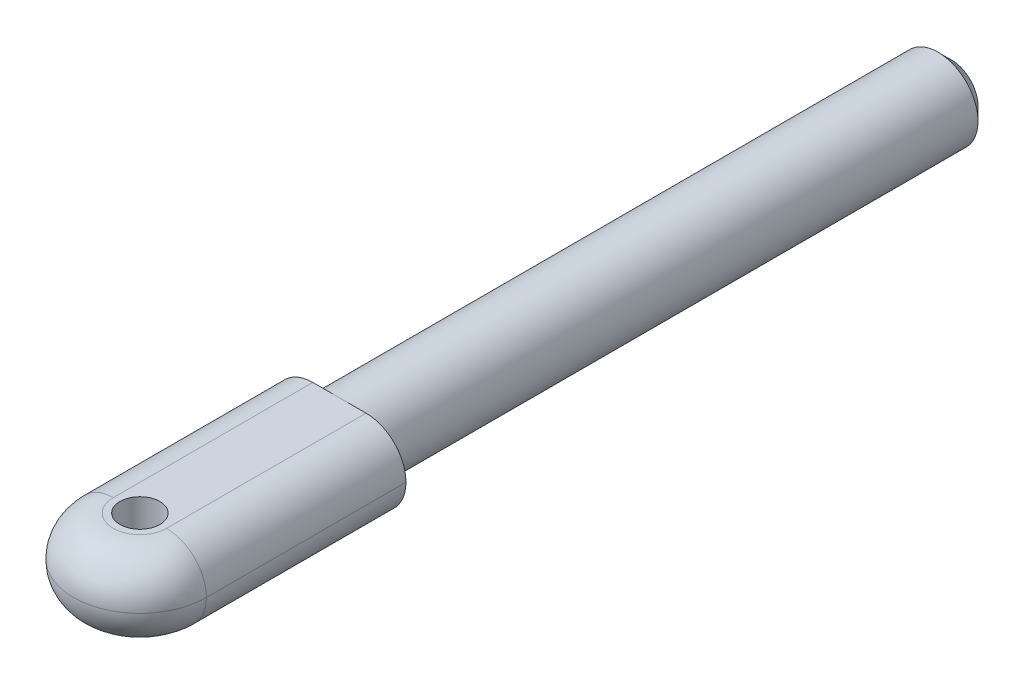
ISO-10303-21;
HEADER;
FILE_DESCRIPTION(('STEP AP214'),'2;1');
FILE_NAME('part.step','',(''),(''),'','','');
FILE_SCHEMA(('AUTOMOTIVE_DESIGN { 1 0 10303 214 1 1 1 1 }'));
ENDSEC;
DATA;
#1=APPLICATION_CONTEXT('core data for automotive mechanical design processes');
#2=APPLICATION_PROTOCOL_DEFINITION('international standard','automotive_design',2000,#1);
#3=PRODUCT_CONTEXT('',#1,'mechanical');
#4=PRODUCT('Part','Part','',(#3));
#5=PRODUCT_RELATED_PRODUCT_CATEGORY('part','',(#4));
#6=PRODUCT_DEFINITION_FORMATION('','',#4);
#7=PRODUCT_DEFINITION_CONTEXT('part definition',#1,'design');
#8=PRODUCT_DEFINITION('design','',#6,#7);
#9=PRODUCT_DEFINITION_SHAPE('','',#8);
#10=(LENGTH_UNIT() NAMED_UNIT(*) SI_UNIT(.MILLI.,.METRE.));
#11=(NAMED_UNIT(*) PLANE_ANGLE_UNIT() SI_UNIT($,.RADIAN.));
#12=(NAMED_UNIT(*) SI_UNIT($,.STERADIAN.) SOLID_ANGLE_UNIT());
#13=UNCERTAINTY_MEASURE_WITH_UNIT(LENGTH_MEASURE(1.E-05),#10,'distance_accuracy_value','');
#14=(GEOMETRIC_REPRESENTATION_CONTEXT(3) GLOBAL_UNCERTAINTY_ASSIGNED_CONTEXT((#13)) GLOBAL_UNIT_ASSIGNED_CONTEXT((#10,
#11,#12)) REPRESENTATION_CONTEXT('',''));
#15=CARTESIAN_POINT('',(0.,0.,0.));
#16=DIRECTION('',(0.,0.,1.));
#17=DIRECTION('',(1.,0.,0.));
#18=AXIS2_PLACEMENT_3D('',#15,#16,#17);
#19=CARTESIAN_POINT('',(0.,-3.,46.));
#20=DIRECTION('',(0.,0.,-1.));
#21=DIRECTION('',(-1.,0.,0.));
#22=AXIS2_PLACEMENT_3D('',#19,#20,#21);
#23=PLANE('',#22);
#24=CARTESIAN_POINT('',(2.,0.,46.));
#25=DIRECTION('',(0.,0.,-1.));
#26=DIRECTION('',(-1.,0.,0.));
#27=AXIS2_PLACEMENT_3D('',#24,#25,#26);
#28=CIRCLE('',#27,3.);
#29=CARTESIAN_POINT('',(2.,3.,46.));
#30=VERTEX_POINT('',#29);
#31=CARTESIAN_POINT('',(5.,0.,46.));
#32=VERTEX_POINT('',#31);
#33=EDGE_CURVE('E141',#30,#32,#28,.T.);
#34=ORIENTED_EDGE('',*,*,#33,.T.);
#35=CARTESIAN_POINT('',(2.,0.,46.));
#36=DIRECTION('',(0.,0.,-1.));
#37=DIRECTION('',(-1.,0.,0.));
#38=AXIS2_PLACEMENT_3D('',#35,#36,#37);
#39=CIRCLE('',#38,3.);
#40=CARTESIAN_POINT('',(2.,-3.,46.));
#41=VERTEX_POINT('',#40);
#42=EDGE_CURVE('E117',#32,#41,#39,.T.);
#43=ORIENTED_EDGE('',*,*,#42,.T.);
#44=DIRECTION('',(-1.,0.,0.));
#45=VECTOR('',#44,1.);
#46=CARTESIAN_POINT('',(5.,-3.,46.));
#47=LINE('',#46,#45);
#48=CARTESIAN_POINT('',(0.,-3.,46.));
#49=VERTEX_POINT('',#48);
#50=EDGE_CURVE('E135',#41,#49,#47,.T.);
#51=ORIENTED_EDGE('',*,*,#50,.T.);
#52=CARTESIAN_POINT('',(0.,0.,46.));
#53=DIRECTION('',(0.,0.,1.));
#54=DIRECTION('',(1.,0.,0.));
#55=AXIS2_PLACEMENT_3D('',#52,#53,#54);
#56=CIRCLE('',#55,3.);
#57=CARTESIAN_POINT('',(0.,3.,46.));
#58=VERTEX_POINT('',#57);
#59=EDGE_CURVE('E137',#49,#58,#56,.T.);
#60=ORIENTED_EDGE('',*,*,#59,.T.);
#61=DIRECTION('',(-1.,0.,0.));
#62=VECTOR('',#61,1.);
#63=CARTESIAN_POINT('',(5.,3.,46.));
#64=LINE('',#63,#62);
#65=EDGE_CURVE('E132',#30,#58,#64,.T.);
#66=ORIENTED_EDGE('',*,*,#65,.F.);
#67=EDGE_LOOP('',(#34,#43,#51,#60,#66));
#68=FACE_BOUND('',#67,.T.);
#69=ADVANCED_FACE('F26',(#68),#23,.T.);
#70=CARTESIAN_POINT('',(-2.,-3.,46.));
#71=VERTEX_POINT('',#70);
#72=EDGE_CURVE('E134',#49,#71,#47,.T.);
#73=ORIENTED_EDGE('',*,*,#72,.T.);
#74=CARTESIAN_POINT('',(-2.,0.,46.));
#75=DIRECTION('',(0.,0.,-1.));
#76=DIRECTION('',(-1.,0.,0.));
#77=AXIS2_PLACEMENT_3D('',#74,#75,#76);
#78=CIRCLE('',#77,3.);
#79=CARTESIAN_POINT('',(-5.,0.,46.));
#80=VERTEX_POINT('',#79);
#81=EDGE_CURVE('E41',#71,#80,#78,.T.);
#82=ORIENTED_EDGE('',*,*,#81,.T.);
#83=CARTESIAN_POINT('',(-2.,0.,46.));
#84=DIRECTION('',(0.,0.,-1.));
#85=DIRECTION('',(-1.,0.,0.));
#86=AXIS2_PLACEMENT_3D('',#83,#84,#85);
#87=CIRCLE('',#86,3.);
#88=CARTESIAN_POINT('',(-2.,3.,46.));
#89=VERTEX_POINT('',#88);
#90=EDGE_CURVE('E153',#80,#89,#87,.T.);
#91=ORIENTED_EDGE('',*,*,#90,.T.);
#92=EDGE_CURVE('E131',#58,#89,#64,.T.);
#93=ORIENTED_EDGE('',*,*,#92,.F.);
#94=EDGE_CURVE('E138',#58,#49,#56,.T.);
#95=ORIENTED_EDGE('',*,*,#94,.T.);
#96=EDGE_LOOP('',(#73,#82,#91,#93,#95));
#97=FACE_BOUND('',#96,.T.);
#98=ADVANCED_FACE('F170',(#97),#23,.T.);
#99=CARTESIAN_POINT('',(0.,-3.,61.));
#100=DIRECTION('',(0.,1.,0.));
#101=DIRECTION('',(0.,0.,1.));
#102=AXIS2_PLACEMENT_3D('',#99,#100,#101);
#103=PLANE('',#102);
#104=CARTESIAN_POINT('',(0.,-3.,61.));
#105=DIRECTION('',(0.,1.,0.));
#106=DIRECTION('',(0.,0.,1.));
#107=AXIS2_PLACEMENT_3D('',#104,#105,#106);
#108=CIRCLE('',#107,1.5);
#109=CARTESIAN_POINT('',(0.,-3.,62.5));
#110=VERTEX_POINT('',#109);
#111=EDGE_CURVE('E128',#110,#110,#108,.T.);
#112=ORIENTED_EDGE('',*,*,#111,.T.);
#113=EDGE_LOOP('',(#112));
#114=FACE_BOUND('',#113,.T.);
#115=ORIENTED_EDGE('',*,*,#50,.F.);
#116=DIRECTION('',(0.,0.,-1.));
#117=VECTOR('',#116,1.);
#118=CARTESIAN_POINT('',(2.,-3.,61.));
#119=LINE('',#118,#117);
#120=CARTESIAN_POINT('',(2.,-3.,61.));
#121=VERTEX_POINT('',#120);
#122=EDGE_CURVE('E147',#41,#121,#119,.F.);
#123=ORIENTED_EDGE('',*,*,#122,.T.);
#124=CARTESIAN_POINT('',(0.,-3.,61.));
#125=DIRECTION('',(0.,1.,0.));
#126=DIRECTION('',(0.,0.,1.));
#127=AXIS2_PLACEMENT_3D('',#124,#125,#126);
#128=CIRCLE('',#127,2.);
#129=CARTESIAN_POINT('',(-2.,-3.,61.));
#130=VERTEX_POINT('',#129);
#131=EDGE_CURVE('E111',#121,#130,#128,.F.);
#132=ORIENTED_EDGE('',*,*,#131,.T.);
#133=DIRECTION('',(0.,0.,1.));
#134=VECTOR('',#133,1.);
#135=CARTESIAN_POINT('',(-2.,-3.,46.));
#136=LINE('',#135,#134);
#137=EDGE_CURVE('E144',#130,#71,#136,.F.);
#138=ORIENTED_EDGE('',*,*,#137,.T.);
#139=ORIENTED_EDGE('',*,*,#72,.F.);
#140=EDGE_LOOP('',(#115,#123,#132,#138,#139));
#141=FACE_BOUND('',#140,.T.);
#142=ADVANCED_FACE('F176',(#114,#141),#103,.F.);
#143=CARTESIAN_POINT('',(0.,3.,61.));
#144=DIRECTION('',(0.,1.,0.));
#145=DIRECTION('',(0.,0.,1.));
#146=AXIS2_PLACEMENT_3D('',#143,#144,#145);
#147=PLANE('',#146);
#148=CARTESIAN_POINT('',(0.,3.,61.));
#149=DIRECTION('',(0.,1.,0.));
#150=DIRECTION('',(0.,0.,1.));
#151=AXIS2_PLACEMENT_3D('',#148,#149,#150);
#152=CIRCLE('',#151,1.5);
#153=CARTESIAN_POINT('',(0.,3.,62.5));
#154=VERTEX_POINT('',#153);
#155=EDGE_CURVE('E125',#154,#154,#152,.T.);
#156=ORIENTED_EDGE('',*,*,#155,.F.);
#157=EDGE_LOOP('',(#156));
#158=FACE_BOUND('',#157,.T.);
#159=CARTESIAN_POINT('',(0.,3.,61.));
#160=DIRECTION('',(0.,1.,0.));
#161=DIRECTION('',(0.,0.,1.));
#162=AXIS2_PLACEMENT_3D('',#159,#160,#161);
#163=CIRCLE('',#162,2.);
#164=CARTESIAN_POINT('',(-2.,3.,61.));
#165=VERTEX_POINT('',#164);
#166=CARTESIAN_POINT('',(2.,3.,61.));
#167=VERTEX_POINT('',#166);
#168=EDGE_CURVE('E49',#165,#167,#163,.T.);
#169=ORIENTED_EDGE('',*,*,#168,.T.);
#170=DIRECTION('',(0.,0.,-1.));
#171=VECTOR('',#170,1.);
#172=CARTESIAN_POINT('',(2.,3.,61.));
#173=LINE('',#172,#171);
#174=EDGE_CURVE('E106',#167,#30,#173,.T.);
#175=ORIENTED_EDGE('',*,*,#174,.T.);
#176=ORIENTED_EDGE('',*,*,#65,.T.);
#177=ORIENTED_EDGE('',*,*,#92,.T.);
#178=DIRECTION('',(0.,0.,1.));
#179=VECTOR('',#178,1.);
#180=CARTESIAN_POINT('',(-2.,3.,61.));
#181=LINE('',#180,#179);
#182=EDGE_CURVE('E149',#89,#165,#181,.T.);
#183=ORIENTED_EDGE('',*,*,#182,.T.);
#184=EDGE_LOOP('',(#169,#175,#176,#177,#183));
#185=FACE_BOUND('',#184,.T.);
#186=ADVANCED_FACE('F190',(#158,#185),#147,.T.);
#187=CARTESIAN_POINT('',(0.,0.,46.));
#188=DIRECTION('',(0.,0.,-1.));
#189=DIRECTION('',(-1.,0.,0.));
#190=AXIS2_PLACEMENT_3D('',#187,#188,#189);
#191=CYLINDRICAL_SURFACE('',#190,3.);
#192=CARTESIAN_POINT('',(0.,0.,1.00000000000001));
#193=DIRECTION('',(0.,0.,1.));
#194=DIRECTION('',(1.,0.,0.));
#195=AXIS2_PLACEMENT_3D('',#192,#193,#194);
#196=CIRCLE('',#195,3.);
#197=CARTESIAN_POINT('',(3.,0.,1.00000000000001));
#198=VERTEX_POINT('',#197);
#199=EDGE_CURVE('E34',#198,#198,#196,.T.);
#200=ORIENTED_EDGE('',*,*,#199,.T.);
#201=EDGE_LOOP('',(#200));
#202=FACE_BOUND('',#201,.T.);
#203=ORIENTED_EDGE('',*,*,#94,.F.);
#204=ORIENTED_EDGE('',*,*,#59,.F.);
#205=EDGE_LOOP('',(#203,#204));
#206=FACE_BOUND('',#205,.T.);
#207=ADVANCED_FACE('F28',(#202,#206),#191,.T.);
#208=CARTESIAN_POINT('',(0.,0.,0.));
#209=DIRECTION('',(0.,0.,1.));
#210=DIRECTION('',(1.,0.,0.));
#211=AXIS2_PLACEMENT_3D('',#208,#209,#210);
#212=PLANE('',#211);
#213=CARTESIAN_POINT('',(0.,0.,0.));
#214=DIRECTION('',(0.,0.,1.));
#215=DIRECTION('',(1.,0.,0.));
#216=AXIS2_PLACEMENT_3D('',#213,#214,#215);
#217=CIRCLE('',#216,1.99999999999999);
#218=CARTESIAN_POINT('',(1.99999999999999,0.,0.));
#219=VERTEX_POINT('',#218);
#220=EDGE_CURVE('E11',#219,#219,#217,.F.);
#221=ORIENTED_EDGE('',*,*,#220,.T.);
#222=EDGE_LOOP('',(#221));
#223=FACE_BOUND('',#222,.T.);
#224=ADVANCED_FACE('F179',(#223),#212,.F.);
#225=CARTESIAN_POINT('',(0.,-3.,61.));
#226=DIRECTION('',(0.,1.,0.));
#227=DIRECTION('',(0.,0.,1.));
#228=AXIS2_PLACEMENT_3D('',#225,#226,#227);
#229=CYLINDRICAL_SURFACE('',#228,1.5);
#230=ORIENTED_EDGE('',*,*,#111,.F.);
#231=EDGE_LOOP('',(#230));
#232=FACE_BOUND('',#231,.T.);
#233=ORIENTED_EDGE('',*,*,#155,.T.);
#234=EDGE_LOOP('',(#233));
#235=FACE_BOUND('',#234,.T.);
#236=ADVANCED_FACE('F181',(#232,#235),#229,.F.);
#237=CARTESIAN_POINT('',(-2.,0.,61.));
#238=DIRECTION('',(0.,0.,1.));
#239=DIRECTION('',(1.,0.,0.));
#240=AXIS2_PLACEMENT_3D('',#237,#238,#239);
#241=CYLINDRICAL_SURFACE('',#240,3.);
#242=ORIENTED_EDGE('',*,*,#182,.F.);
#243=ORIENTED_EDGE('',*,*,#90,.F.);
#244=DIRECTION('',(0.,0.,1.));
#245=VECTOR('',#244,1.);
#246=CARTESIAN_POINT('',(-5.,0.,46.));
#247=LINE('',#246,#245);
#248=CARTESIAN_POINT('',(-5.,0.,61.));
#249=VERTEX_POINT('',#248);
#250=EDGE_CURVE('E122',#249,#80,#247,.F.);
#251=ORIENTED_EDGE('',*,*,#250,.F.);
#252=CARTESIAN_POINT('',(-2.,0.,61.));
#253=DIRECTION('',(0.,0.,1.));
#254=DIRECTION('',(1.,0.,0.));
#255=AXIS2_PLACEMENT_3D('',#252,#253,#254);
#256=CIRCLE('',#255,3.);
#257=EDGE_CURVE('E92',#165,#249,#256,.T.);
#258=ORIENTED_EDGE('',*,*,#257,.F.);
#259=EDGE_LOOP('',(#242,#243,#251,#258));
#260=FACE_BOUND('',#259,.T.);
#261=ADVANCED_FACE('F187',(#260),#241,.T.);
#262=CARTESIAN_POINT('',(-2.,0.,46.));
#263=DIRECTION('',(0.,0.,-1.));
#264=DIRECTION('',(-1.,0.,0.));
#265=AXIS2_PLACEMENT_3D('',#262,#263,#264);
#266=CYLINDRICAL_SURFACE('',#265,3.);
#267=ORIENTED_EDGE('',*,*,#81,.F.);
#268=ORIENTED_EDGE('',*,*,#137,.F.);
#269=CARTESIAN_POINT('',(-2.,0.,61.));
#270=DIRECTION('',(0.,0.,1.));
#271=DIRECTION('',(1.,0.,0.));
#272=AXIS2_PLACEMENT_3D('',#269,#270,#271);
#273=CIRCLE('',#272,3.);
#274=EDGE_CURVE('E97',#249,#130,#273,.T.);
#275=ORIENTED_EDGE('',*,*,#274,.F.);
#276=ORIENTED_EDGE('',*,*,#250,.T.);
#277=EDGE_LOOP('',(#267,#268,#275,#276));
#278=FACE_BOUND('',#277,.T.);
#279=ADVANCED_FACE('F203',(#278),#266,.T.);
#280=CARTESIAN_POINT('',(0.,0.,61.));
#281=DIRECTION('',(0.,1.,0.));
#282=DIRECTION('',(0.,0.,1.));
#283=AXIS2_PLACEMENT_3D('',#280,#281,#282);
#284=DEGENERATE_TOROIDAL_SURFACE('',#283,2.,3.,.T.);
#285=ORIENTED_EDGE('',*,*,#168,.F.);
#286=ORIENTED_EDGE('',*,*,#257,.T.);
#287=CARTESIAN_POINT('',(0.,0.,61.));
#288=DIRECTION('',(0.,1.,0.));
#289=DIRECTION('',(0.,0.,1.));
#290=AXIS2_PLACEMENT_3D('',#287,#288,#289);
#291=CIRCLE('',#290,5.);
#292=CARTESIAN_POINT('',(5.,0.,61.));
#293=VERTEX_POINT('',#292);
#294=EDGE_CURVE('E86',#293,#249,#291,.F.);
#295=ORIENTED_EDGE('',*,*,#294,.F.);
#296=CARTESIAN_POINT('',(2.,0.,61.));
#297=DIRECTION('',(0.,0.,-1.));
#298=DIRECTION('',(-1.,0.,0.));
#299=AXIS2_PLACEMENT_3D('',#296,#297,#298);
#300=CIRCLE('',#299,3.);
#301=EDGE_CURVE('E89',#167,#293,#300,.T.);
#302=ORIENTED_EDGE('',*,*,#301,.F.);
#303=EDGE_LOOP('',(#285,#286,#295,#302));
#304=FACE_BOUND('',#303,.T.);
#305=ADVANCED_FACE('F88',(#304),#284,.T.);
#306=CARTESIAN_POINT('',(0.,0.,61.));
#307=DIRECTION('',(0.,1.,0.));
#308=DIRECTION('',(0.,0.,1.));
#309=AXIS2_PLACEMENT_3D('',#306,#307,#308);
#310=DEGENERATE_TOROIDAL_SURFACE('',#309,2.,3.,.T.);
#311=ORIENTED_EDGE('',*,*,#274,.T.);
#312=ORIENTED_EDGE('',*,*,#131,.F.);
#313=CARTESIAN_POINT('',(2.,0.,61.));
#314=DIRECTION('',(0.,0.,-1.));
#315=DIRECTION('',(-1.,0.,0.));
#316=AXIS2_PLACEMENT_3D('',#313,#314,#315);
#317=CIRCLE('',#316,3.);
#318=EDGE_CURVE('E107',#293,#121,#317,.T.);
#319=ORIENTED_EDGE('',*,*,#318,.F.);
#320=ORIENTED_EDGE('',*,*,#294,.T.);
#321=EDGE_LOOP('',(#311,#312,#319,#320));
#322=FACE_BOUND('',#321,.T.);
#323=ADVANCED_FACE('F110',(#322),#310,.T.);
#324=CARTESIAN_POINT('',(2.,0.,61.));
#325=DIRECTION('',(0.,0.,-1.));
#326=DIRECTION('',(-1.,0.,0.));
#327=AXIS2_PLACEMENT_3D('',#324,#325,#326);
#328=CYLINDRICAL_SURFACE('',#327,3.);
#329=ORIENTED_EDGE('',*,*,#174,.F.);
#330=ORIENTED_EDGE('',*,*,#301,.T.);
#331=DIRECTION('',(0.,0.,-1.));
#332=VECTOR('',#331,1.);
#333=CARTESIAN_POINT('',(5.,0.,61.));
#334=LINE('',#333,#332);
#335=EDGE_CURVE('E104',#32,#293,#334,.F.);
#336=ORIENTED_EDGE('',*,*,#335,.F.);
#337=ORIENTED_EDGE('',*,*,#33,.F.);
#338=EDGE_LOOP('',(#329,#330,#336,#337));
#339=FACE_BOUND('',#338,.T.);
#340=ADVANCED_FACE('F101',(#339),#328,.T.);
#341=CARTESIAN_POINT('',(2.,0.,61.));
#342=DIRECTION('',(0.,0.,1.));
#343=DIRECTION('',(1.,0.,0.));
#344=AXIS2_PLACEMENT_3D('',#341,#342,#343);
#345=CYLINDRICAL_SURFACE('',#344,3.);
#346=ORIENTED_EDGE('',*,*,#318,.T.);
#347=ORIENTED_EDGE('',*,*,#122,.F.);
#348=ORIENTED_EDGE('',*,*,#42,.F.);
#349=ORIENTED_EDGE('',*,*,#335,.T.);
#350=EDGE_LOOP('',(#346,#347,#348,#349));
#351=FACE_BOUND('',#350,.T.);
#352=ADVANCED_FACE('F116',(#351),#345,.T.);
#353=CARTESIAN_POINT('',(0.,0.,1.00000000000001));
#354=DIRECTION('',(0.,0.,1.));
#355=DIRECTION('',(1.,0.,0.));
#356=AXIS2_PLACEMENT_3D('',#353,#354,#355);
#357=CONICAL_SURFACE('',#356,3.,0.785398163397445);
#358=ORIENTED_EDGE('',*,*,#220,.F.);
#359=EDGE_LOOP('',(#358));
#360=FACE_BOUND('',#359,.T.);
#361=ORIENTED_EDGE('',*,*,#199,.F.);
#362=EDGE_LOOP('',(#361));
#363=FACE_BOUND('',#362,.T.);
#364=ADVANCED_FACE('F160',(#360,#363),#357,.T.);
#365=CLOSED_SHELL('',(#69,#98,#142,#186,#207,#224,#236,#261,#279,#305,#323,#340,#352,#364));
#366=MANIFOLD_SOLID_BREP('B2',#365);
#367=ADVANCED_BREP_SHAPE_REPRESENTATION('',(#18,#366),#14);
#368=SHAPE_DEFINITION_REPRESENTATION(#9,#367);
ENDSEC;
END-ISO-10303-21;
